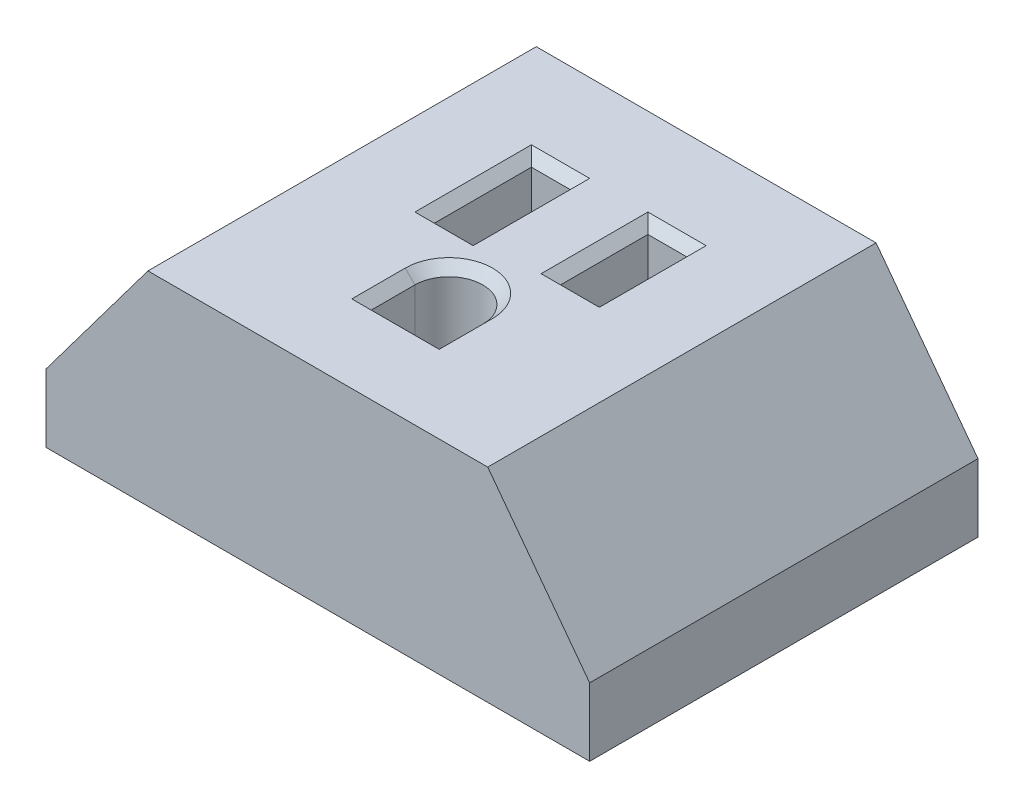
ISO-10303-21;
HEADER;
FILE_DESCRIPTION(('STEP AP214'),'2;1');
FILE_NAME('part.step','',(''),(''),'','','');
FILE_SCHEMA(('AUTOMOTIVE_DESIGN { 1 0 10303 214 1 1 1 1 }'));
ENDSEC;
DATA;
#1=APPLICATION_CONTEXT('core data for automotive mechanical design processes');
#2=APPLICATION_PROTOCOL_DEFINITION('international standard','automotive_design',2000,#1);
#3=PRODUCT_CONTEXT('',#1,'mechanical');
#4=PRODUCT('Part','Part','',(#3));
#5=PRODUCT_RELATED_PRODUCT_CATEGORY('part','',(#4));
#6=PRODUCT_DEFINITION_FORMATION('','',#4);
#7=PRODUCT_DEFINITION_CONTEXT('part definition',#1,'design');
#8=PRODUCT_DEFINITION('design','',#6,#7);
#9=PRODUCT_DEFINITION_SHAPE('','',#8);
#10=(LENGTH_UNIT() NAMED_UNIT(*) SI_UNIT(.MILLI.,.METRE.));
#11=(NAMED_UNIT(*) PLANE_ANGLE_UNIT() SI_UNIT($,.RADIAN.));
#12=(NAMED_UNIT(*) SI_UNIT($,.STERADIAN.) SOLID_ANGLE_UNIT());
#13=UNCERTAINTY_MEASURE_WITH_UNIT(LENGTH_MEASURE(1.E-05),#10,'distance_accuracy_value','');
#14=(GEOMETRIC_REPRESENTATION_CONTEXT(3) GLOBAL_UNCERTAINTY_ASSIGNED_CONTEXT((#13)) GLOBAL_UNIT_ASSIGNED_CONTEXT((#10,
#11,#12)) REPRESENTATION_CONTEXT('',''));
#15=CARTESIAN_POINT('',(0.,0.,0.));
#16=DIRECTION('',(0.,0.,1.));
#17=DIRECTION('',(1.,0.,0.));
#18=AXIS2_PLACEMENT_3D('',#15,#16,#17);
#19=CARTESIAN_POINT('',(-28.,0.,-40.));
#20=DIRECTION('',(-1.,0.,0.));
#21=DIRECTION('',(0.,0.,1.));
#22=AXIS2_PLACEMENT_3D('',#19,#20,#21);
#23=PLANE('',#22);
#24=DIRECTION('',(0.,-1.,0.));
#25=VECTOR('',#24,1.);
#26=CARTESIAN_POINT('',(-28.,0.,0.));
#27=LINE('',#26,#25);
#28=CARTESIAN_POINT('',(-28.,7.,0.));
#29=VERTEX_POINT('',#28);
#30=CARTESIAN_POINT('',(-28.,0.,0.));
#31=VERTEX_POINT('',#30);
#32=EDGE_CURVE('E270',#29,#31,#27,.T.);
#33=ORIENTED_EDGE('',*,*,#32,.F.);
#34=DIRECTION('',(0.,0.,1.));
#35=VECTOR('',#34,1.);
#36=CARTESIAN_POINT('',(-28.,7.,-40.));
#37=LINE('',#36,#35);
#38=CARTESIAN_POINT('',(-28.,7.,-40.));
#39=VERTEX_POINT('',#38);
#40=EDGE_CURVE('E307',#39,#29,#37,.T.);
#41=ORIENTED_EDGE('',*,*,#40,.F.);
#42=DIRECTION('',(0.,-1.,0.));
#43=VECTOR('',#42,1.);
#44=CARTESIAN_POINT('',(-28.,0.,-40.));
#45=LINE('',#44,#43);
#46=CARTESIAN_POINT('',(-28.,0.,-40.));
#47=VERTEX_POINT('',#46);
#48=EDGE_CURVE('E288',#39,#47,#45,.T.);
#49=ORIENTED_EDGE('',*,*,#48,.T.);
#50=DIRECTION('',(0.,0.,1.));
#51=VECTOR('',#50,1.);
#52=CARTESIAN_POINT('',(-28.,0.,-40.));
#53=LINE('',#52,#51);
#54=EDGE_CURVE('E306',#47,#31,#53,.T.);
#55=ORIENTED_EDGE('',*,*,#54,.T.);
#56=EDGE_LOOP('',(#33,#41,#49,#55));
#57=FACE_BOUND('',#56,.T.);
#58=ADVANCED_FACE('F28',(#57),#23,.T.);
#59=CARTESIAN_POINT('',(-28.,7.,-40.));
#60=DIRECTION('',(-0.8,0.6,0.));
#61=DIRECTION('',(-0.6,-0.8,0.));
#62=AXIS2_PLACEMENT_3D('',#59,#60,#61);
#63=PLANE('',#62);
#64=DIRECTION('',(-0.6,-0.8,0.));
#65=VECTOR('',#64,1.);
#66=CARTESIAN_POINT('',(-28.,7.,0.));
#67=LINE('',#66,#65);
#68=CARTESIAN_POINT('',(-17.5,21.,0.));
#69=VERTEX_POINT('',#68);
#70=EDGE_CURVE('E285',#69,#29,#67,.T.);
#71=ORIENTED_EDGE('',*,*,#70,.F.);
#72=DIRECTION('',(0.,0.,1.));
#73=VECTOR('',#72,1.);
#74=CARTESIAN_POINT('',(-17.5,21.,-40.));
#75=LINE('',#74,#73);
#76=CARTESIAN_POINT('',(-17.5,21.,-40.));
#77=VERTEX_POINT('',#76);
#78=EDGE_CURVE('E310',#77,#69,#75,.T.);
#79=ORIENTED_EDGE('',*,*,#78,.F.);
#80=DIRECTION('',(-0.6,-0.8,0.));
#81=VECTOR('',#80,1.);
#82=CARTESIAN_POINT('',(-28.,7.,-40.));
#83=LINE('',#82,#81);
#84=EDGE_CURVE('E303',#77,#39,#83,.T.);
#85=ORIENTED_EDGE('',*,*,#84,.T.);
#86=ORIENTED_EDGE('',*,*,#40,.T.);
#87=EDGE_LOOP('',(#71,#79,#85,#86));
#88=FACE_BOUND('',#87,.T.);
#89=ADVANCED_FACE('F447',(#88),#63,.T.);
#90=CARTESIAN_POINT('',(-17.5,21.,-40.));
#91=DIRECTION('',(0.,1.,0.));
#92=DIRECTION('',(0.,0.,1.));
#93=AXIS2_PLACEMENT_3D('',#90,#91,#92);
#94=PLANE('',#93);
#95=DIRECTION('',(0.,0.,-1.));
#96=VECTOR('',#95,1.);
#97=CARTESIAN_POINT('',(-4.5,21.,-13.5));
#98=LINE('',#97,#96);
#99=CARTESIAN_POINT('',(-4.5,21.,-7.99999999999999));
#100=VERTEX_POINT('',#99);
#101=CARTESIAN_POINT('',(-4.5,21.,-13.5));
#102=VERTEX_POINT('',#101);
#103=EDGE_CURVE('E342',#100,#102,#98,.T.);
#104=ORIENTED_EDGE('',*,*,#103,.T.);
#105=CARTESIAN_POINT('',(0.,21.,-13.5));
#106=DIRECTION('',(0.,1.,0.));
#107=DIRECTION('',(0.,0.,1.));
#108=AXIS2_PLACEMENT_3D('',#105,#106,#107);
#109=CIRCLE('',#108,4.5);
#110=CARTESIAN_POINT('',(4.50000000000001,21.,-13.5));
#111=VERTEX_POINT('',#110);
#112=EDGE_CURVE('E344',#102,#111,#109,.F.);
#113=ORIENTED_EDGE('',*,*,#112,.T.);
#114=DIRECTION('',(0.,0.,1.));
#115=VECTOR('',#114,1.);
#116=CARTESIAN_POINT('',(4.5,21.,-9.));
#117=LINE('',#116,#115);
#118=CARTESIAN_POINT('',(4.5,21.,-7.99999999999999));
#119=VERTEX_POINT('',#118);
#120=EDGE_CURVE('E338',#111,#119,#117,.T.);
#121=ORIENTED_EDGE('',*,*,#120,.T.);
#122=DIRECTION('',(-1.,0.,0.));
#123=VECTOR('',#122,1.);
#124=CARTESIAN_POINT('',(-3.5,21.,-7.99999999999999));
#125=LINE('',#124,#123);
#126=EDGE_CURVE('E340',#119,#100,#125,.T.);
#127=ORIENTED_EDGE('',*,*,#126,.T.);
#128=EDGE_LOOP('',(#104,#113,#121,#127));
#129=FACE_BOUND('',#128,.T.);
#130=DIRECTION('',(0.,0.,1.));
#131=VECTOR('',#130,1.);
#132=CARTESIAN_POINT('',(9.,21.,-21.));
#133=LINE('',#132,#131);
#134=CARTESIAN_POINT('',(9.,21.,-31.));
#135=VERTEX_POINT('',#134);
#136=CARTESIAN_POINT('',(9.,21.,-20.));
#137=VERTEX_POINT('',#136);
#138=EDGE_CURVE('E333',#135,#137,#133,.T.);
#139=ORIENTED_EDGE('',*,*,#138,.T.);
#140=DIRECTION('',(-1.,0.,0.));
#141=VECTOR('',#140,1.);
#142=CARTESIAN_POINT('',(4.,21.,-20.));
#143=LINE('',#142,#141);
#144=CARTESIAN_POINT('',(3.,21.,-20.));
#145=VERTEX_POINT('',#144);
#146=EDGE_CURVE('E335',#137,#145,#143,.T.);
#147=ORIENTED_EDGE('',*,*,#146,.T.);
#148=DIRECTION('',(0.,0.,-1.));
#149=VECTOR('',#148,1.);
#150=CARTESIAN_POINT('',(3.,21.,-30.));
#151=LINE('',#150,#149);
#152=CARTESIAN_POINT('',(3.,21.,-31.));
#153=VERTEX_POINT('',#152);
#154=EDGE_CURVE('E329',#145,#153,#151,.T.);
#155=ORIENTED_EDGE('',*,*,#154,.T.);
#156=DIRECTION('',(1.,0.,0.));
#157=VECTOR('',#156,1.);
#158=CARTESIAN_POINT('',(8.,21.,-31.));
#159=LINE('',#158,#157);
#160=EDGE_CURVE('E331',#153,#135,#159,.T.);
#161=ORIENTED_EDGE('',*,*,#160,.T.);
#162=EDGE_LOOP('',(#139,#147,#155,#161));
#163=FACE_BOUND('',#162,.T.);
#164=DIRECTION('',(0.,0.,1.));
#165=VECTOR('',#164,1.);
#166=CARTESIAN_POINT('',(-2.99999999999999,21.,-20.));
#167=LINE('',#166,#165);
#168=CARTESIAN_POINT('',(-2.99999999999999,21.,-31.));
#169=VERTEX_POINT('',#168);
#170=CARTESIAN_POINT('',(-2.99999999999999,21.,-19.));
#171=VERTEX_POINT('',#170);
#172=EDGE_CURVE('E324',#169,#171,#167,.T.);
#173=ORIENTED_EDGE('',*,*,#172,.T.);
#174=DIRECTION('',(-1.,0.,0.));
#175=VECTOR('',#174,1.);
#176=CARTESIAN_POINT('',(-8.,21.,-19.));
#177=LINE('',#176,#175);
#178=CARTESIAN_POINT('',(-9.,21.,-19.));
#179=VERTEX_POINT('',#178);
#180=EDGE_CURVE('E326',#171,#179,#177,.T.);
#181=ORIENTED_EDGE('',*,*,#180,.T.);
#182=DIRECTION('',(0.,0.,-1.));
#183=VECTOR('',#182,1.);
#184=CARTESIAN_POINT('',(-9.,21.,-30.));
#185=LINE('',#184,#183);
#186=CARTESIAN_POINT('',(-9.,21.,-31.));
#187=VERTEX_POINT('',#186);
#188=EDGE_CURVE('E320',#179,#187,#185,.T.);
#189=ORIENTED_EDGE('',*,*,#188,.T.);
#190=DIRECTION('',(1.,0.,0.));
#191=VECTOR('',#190,1.);
#192=CARTESIAN_POINT('',(-4.,21.,-31.));
#193=LINE('',#192,#191);
#194=EDGE_CURVE('E322',#187,#169,#193,.T.);
#195=ORIENTED_EDGE('',*,*,#194,.T.);
#196=EDGE_LOOP('',(#173,#181,#189,#195));
#197=FACE_BOUND('',#196,.T.);
#198=DIRECTION('',(-1.,0.,0.));
#199=VECTOR('',#198,1.);
#200=CARTESIAN_POINT('',(-17.5,21.,0.));
#201=LINE('',#200,#199);
#202=CARTESIAN_POINT('',(17.5,21.,0.));
#203=VERTEX_POINT('',#202);
#204=EDGE_CURVE('E282',#203,#69,#201,.T.);
#205=ORIENTED_EDGE('',*,*,#204,.F.);
#206=DIRECTION('',(0.,0.,1.));
#207=VECTOR('',#206,1.);
#208=CARTESIAN_POINT('',(17.5,21.,-40.));
#209=LINE('',#208,#207);
#210=CARTESIAN_POINT('',(17.5,21.,-40.));
#211=VERTEX_POINT('',#210);
#212=EDGE_CURVE('E312',#211,#203,#209,.T.);
#213=ORIENTED_EDGE('',*,*,#212,.F.);
#214=DIRECTION('',(-1.,0.,0.));
#215=VECTOR('',#214,1.);
#216=CARTESIAN_POINT('',(-17.5,21.,-40.));
#217=LINE('',#216,#215);
#218=EDGE_CURVE('E300',#211,#77,#217,.T.);
#219=ORIENTED_EDGE('',*,*,#218,.T.);
#220=ORIENTED_EDGE('',*,*,#78,.T.);
#221=EDGE_LOOP('',(#205,#213,#219,#220));
#222=FACE_BOUND('',#221,.T.);
#223=ADVANCED_FACE('F430',(#129,#163,#197,#222),#94,.T.);
#224=CARTESIAN_POINT('',(28.,7.,-40.));
#225=DIRECTION('',(0.8,0.6,0.));
#226=DIRECTION('',(-0.6,0.8,0.));
#227=AXIS2_PLACEMENT_3D('',#224,#225,#226);
#228=PLANE('',#227);
#229=DIRECTION('',(-0.6,0.8,0.));
#230=VECTOR('',#229,1.);
#231=CARTESIAN_POINT('',(28.,7.,0.));
#232=LINE('',#231,#230);
#233=CARTESIAN_POINT('',(28.,7.,0.));
#234=VERTEX_POINT('',#233);
#235=EDGE_CURVE('E279',#234,#203,#232,.T.);
#236=ORIENTED_EDGE('',*,*,#235,.F.);
#237=DIRECTION('',(0.,0.,1.));
#238=VECTOR('',#237,1.);
#239=CARTESIAN_POINT('',(28.,7.,-40.));
#240=LINE('',#239,#238);
#241=CARTESIAN_POINT('',(28.,7.,-40.));
#242=VERTEX_POINT('',#241);
#243=EDGE_CURVE('E314',#242,#234,#240,.T.);
#244=ORIENTED_EDGE('',*,*,#243,.F.);
#245=DIRECTION('',(-0.6,0.8,0.));
#246=VECTOR('',#245,1.);
#247=CARTESIAN_POINT('',(28.,7.,-40.));
#248=LINE('',#247,#246);
#249=EDGE_CURVE('E297',#242,#211,#248,.T.);
#250=ORIENTED_EDGE('',*,*,#249,.T.);
#251=ORIENTED_EDGE('',*,*,#212,.T.);
#252=EDGE_LOOP('',(#236,#244,#250,#251));
#253=FACE_BOUND('',#252,.T.);
#254=ADVANCED_FACE('F473',(#253),#228,.T.);
#255=CARTESIAN_POINT('',(28.,0.,-40.));
#256=DIRECTION('',(1.,0.,0.));
#257=DIRECTION('',(0.,0.,-1.));
#258=AXIS2_PLACEMENT_3D('',#255,#256,#257);
#259=PLANE('',#258);
#260=DIRECTION('',(0.,1.,0.));
#261=VECTOR('',#260,1.);
#262=CARTESIAN_POINT('',(28.,0.,0.));
#263=LINE('',#262,#261);
#264=CARTESIAN_POINT('',(28.,0.,0.));
#265=VERTEX_POINT('',#264);
#266=EDGE_CURVE('E276',#265,#234,#263,.T.);
#267=ORIENTED_EDGE('',*,*,#266,.F.);
#268=DIRECTION('',(0.,0.,1.));
#269=VECTOR('',#268,1.);
#270=CARTESIAN_POINT('',(28.,0.,-40.));
#271=LINE('',#270,#269);
#272=CARTESIAN_POINT('',(28.,0.,-40.));
#273=VERTEX_POINT('',#272);
#274=EDGE_CURVE('E316',#273,#265,#271,.T.);
#275=ORIENTED_EDGE('',*,*,#274,.F.);
#276=DIRECTION('',(0.,1.,0.));
#277=VECTOR('',#276,1.);
#278=CARTESIAN_POINT('',(28.,0.,-40.));
#279=LINE('',#278,#277);
#280=EDGE_CURVE('E294',#273,#242,#279,.T.);
#281=ORIENTED_EDGE('',*,*,#280,.T.);
#282=ORIENTED_EDGE('',*,*,#243,.T.);
#283=EDGE_LOOP('',(#267,#275,#281,#282));
#284=FACE_BOUND('',#283,.T.);
#285=ADVANCED_FACE('F471',(#284),#259,.T.);
#286=CARTESIAN_POINT('',(-28.,0.,-40.));
#287=DIRECTION('',(0.,-1.,0.));
#288=DIRECTION('',(0.,0.,-1.));
#289=AXIS2_PLACEMENT_3D('',#286,#287,#288);
#290=PLANE('',#289);
#291=DIRECTION('',(0.,0.,-1.));
#292=VECTOR('',#291,1.);
#293=CARTESIAN_POINT('',(3.5,0.,-9.));
#294=LINE('',#293,#292);
#295=CARTESIAN_POINT('',(3.5,0.,-9.));
#296=VERTEX_POINT('',#295);
#297=CARTESIAN_POINT('',(3.5,0.,-13.5));
#298=VERTEX_POINT('',#297);
#299=EDGE_CURVE('E207',#296,#298,#294,.T.);
#300=ORIENTED_EDGE('',*,*,#299,.T.);
#301=CARTESIAN_POINT('',(0.,0.,-13.5));
#302=DIRECTION('',(0.,-1.,0.));
#303=DIRECTION('',(0.,0.,-1.));
#304=AXIS2_PLACEMENT_3D('',#301,#302,#303);
#305=CIRCLE('',#304,3.5);
#306=CARTESIAN_POINT('',(-3.5,0.,-13.5));
#307=VERTEX_POINT('',#306);
#308=EDGE_CURVE('E189',#298,#307,#305,.F.);
#309=ORIENTED_EDGE('',*,*,#308,.T.);
#310=DIRECTION('',(0.,0.,1.));
#311=VECTOR('',#310,1.);
#312=CARTESIAN_POINT('',(-3.5,0.,-9.));
#313=LINE('',#312,#311);
#314=CARTESIAN_POINT('',(-3.5,0.,-9.));
#315=VERTEX_POINT('',#314);
#316=EDGE_CURVE('E217',#307,#315,#313,.T.);
#317=ORIENTED_EDGE('',*,*,#316,.T.);
#318=DIRECTION('',(1.,0.,0.));
#319=VECTOR('',#318,1.);
#320=CARTESIAN_POINT('',(-3.5,0.,-9.));
#321=LINE('',#320,#319);
#322=EDGE_CURVE('E215',#315,#296,#321,.T.);
#323=ORIENTED_EDGE('',*,*,#322,.T.);
#324=EDGE_LOOP('',(#300,#309,#317,#323));
#325=FACE_BOUND('',#324,.T.);
#326=DIRECTION('',(0.,0.,1.));
#327=VECTOR('',#326,1.);
#328=CARTESIAN_POINT('',(4.,0.,-30.));
#329=LINE('',#328,#327);
#330=CARTESIAN_POINT('',(4.,0.,-30.));
#331=VERTEX_POINT('',#330);
#332=CARTESIAN_POINT('',(4.,0.,-21.));
#333=VERTEX_POINT('',#332);
#334=EDGE_CURVE('E231',#331,#333,#329,.T.);
#335=ORIENTED_EDGE('',*,*,#334,.T.);
#336=DIRECTION('',(1.,0.,0.));
#337=VECTOR('',#336,1.);
#338=CARTESIAN_POINT('',(4.,0.,-21.));
#339=LINE('',#338,#337);
#340=CARTESIAN_POINT('',(8.,0.,-21.));
#341=VERTEX_POINT('',#340);
#342=EDGE_CURVE('E238',#333,#341,#339,.T.);
#343=ORIENTED_EDGE('',*,*,#342,.T.);
#344=DIRECTION('',(0.,0.,-1.));
#345=VECTOR('',#344,1.);
#346=CARTESIAN_POINT('',(8.,0.,-30.));
#347=LINE('',#346,#345);
#348=CARTESIAN_POINT('',(8.,0.,-30.));
#349=VERTEX_POINT('',#348);
#350=EDGE_CURVE('E201',#341,#349,#347,.T.);
#351=ORIENTED_EDGE('',*,*,#350,.T.);
#352=DIRECTION('',(-1.,0.,0.));
#353=VECTOR('',#352,1.);
#354=CARTESIAN_POINT('',(4.,0.,-30.));
#355=LINE('',#354,#353);
#356=EDGE_CURVE('E228',#349,#331,#355,.T.);
#357=ORIENTED_EDGE('',*,*,#356,.T.);
#358=EDGE_LOOP('',(#335,#343,#351,#357));
#359=FACE_BOUND('',#358,.T.);
#360=DIRECTION('',(0.,0.,1.));
#361=VECTOR('',#360,1.);
#362=CARTESIAN_POINT('',(-8.,0.,-30.));
#363=LINE('',#362,#361);
#364=CARTESIAN_POINT('',(-8.,0.,-30.));
#365=VERTEX_POINT('',#364);
#366=CARTESIAN_POINT('',(-7.99999999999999,0.,-20.));
#367=VERTEX_POINT('',#366);
#368=EDGE_CURVE('E255',#365,#367,#363,.T.);
#369=ORIENTED_EDGE('',*,*,#368,.T.);
#370=DIRECTION('',(1.,0.,0.));
#371=VECTOR('',#370,1.);
#372=CARTESIAN_POINT('',(-7.99999999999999,0.,-20.));
#373=LINE('',#372,#371);
#374=CARTESIAN_POINT('',(-4.,0.,-20.));
#375=VERTEX_POINT('',#374);
#376=EDGE_CURVE('E261',#367,#375,#373,.T.);
#377=ORIENTED_EDGE('',*,*,#376,.T.);
#378=DIRECTION('',(0.,0.,-1.));
#379=VECTOR('',#378,1.);
#380=CARTESIAN_POINT('',(-4.,0.,-30.));
#381=LINE('',#380,#379);
#382=CARTESIAN_POINT('',(-4.,0.,-30.));
#383=VERTEX_POINT('',#382);
#384=EDGE_CURVE('E249',#375,#383,#381,.T.);
#385=ORIENTED_EDGE('',*,*,#384,.T.);
#386=DIRECTION('',(-1.,0.,0.));
#387=VECTOR('',#386,1.);
#388=CARTESIAN_POINT('',(-8.,0.,-30.));
#389=LINE('',#388,#387);
#390=EDGE_CURVE('E252',#383,#365,#389,.T.);
#391=ORIENTED_EDGE('',*,*,#390,.T.);
#392=EDGE_LOOP('',(#369,#377,#385,#391));
#393=FACE_BOUND('',#392,.T.);
#394=DIRECTION('',(1.,0.,0.));
#395=VECTOR('',#394,1.);
#396=CARTESIAN_POINT('',(-28.,0.,0.));
#397=LINE('',#396,#395);
#398=EDGE_CURVE('E273',#31,#265,#397,.T.);
#399=ORIENTED_EDGE('',*,*,#398,.F.);
#400=ORIENTED_EDGE('',*,*,#54,.F.);
#401=DIRECTION('',(1.,0.,0.));
#402=VECTOR('',#401,1.);
#403=CARTESIAN_POINT('',(-28.,0.,-40.));
#404=LINE('',#403,#402);
#405=EDGE_CURVE('E291',#47,#273,#404,.T.);
#406=ORIENTED_EDGE('',*,*,#405,.T.);
#407=ORIENTED_EDGE('',*,*,#274,.T.);
#408=EDGE_LOOP('',(#399,#400,#406,#407));
#409=FACE_BOUND('',#408,.T.);
#410=ADVANCED_FACE('F213',(#325,#359,#393,#409),#290,.T.);
#411=CARTESIAN_POINT('',(-28.,21.,-40.));
#412=DIRECTION('',(0.,0.,-1.));
#413=DIRECTION('',(-1.,0.,0.));
#414=AXIS2_PLACEMENT_3D('',#411,#412,#413);
#415=PLANE('',#414);
#416=ORIENTED_EDGE('',*,*,#48,.F.);
#417=ORIENTED_EDGE('',*,*,#84,.F.);
#418=ORIENTED_EDGE('',*,*,#218,.F.);
#419=ORIENTED_EDGE('',*,*,#249,.F.);
#420=ORIENTED_EDGE('',*,*,#280,.F.);
#421=ORIENTED_EDGE('',*,*,#405,.F.);
#422=EDGE_LOOP('',(#416,#417,#418,#419,#420,#421));
#423=FACE_BOUND('',#422,.T.);
#424=ADVANCED_FACE('F464',(#423),#415,.T.);
#425=CARTESIAN_POINT('',(-28.,21.,0.));
#426=DIRECTION('',(0.,0.,-1.));
#427=DIRECTION('',(-1.,0.,0.));
#428=AXIS2_PLACEMENT_3D('',#425,#426,#427);
#429=PLANE('',#428);
#430=ORIENTED_EDGE('',*,*,#32,.T.);
#431=ORIENTED_EDGE('',*,*,#398,.T.);
#432=ORIENTED_EDGE('',*,*,#266,.T.);
#433=ORIENTED_EDGE('',*,*,#235,.T.);
#434=ORIENTED_EDGE('',*,*,#204,.T.);
#435=ORIENTED_EDGE('',*,*,#70,.T.);
#436=EDGE_LOOP('',(#430,#431,#432,#433,#434,#435));
#437=FACE_BOUND('',#436,.T.);
#438=ADVANCED_FACE('F459',(#437),#429,.F.);
#439=CARTESIAN_POINT('',(-8.,-0.001000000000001,-30.));
#440=DIRECTION('',(-1.,0.,0.));
#441=DIRECTION('',(0.,0.,1.));
#442=AXIS2_PLACEMENT_3D('',#439,#440,#441);
#443=PLANE('',#442);
#444=DIRECTION('',(0.,1.,0.));
#445=VECTOR('',#444,1.);
#446=CARTESIAN_POINT('',(-8.,-0.001000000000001,-30.));
#447=LINE('',#446,#445);
#448=CARTESIAN_POINT('',(-8.,20.,-30.));
#449=VERTEX_POINT('',#448);
#450=EDGE_CURVE('E259',#365,#449,#447,.T.);
#451=ORIENTED_EDGE('',*,*,#450,.T.);
#452=DIRECTION('',(0.,0.,1.));
#453=VECTOR('',#452,1.);
#454=CARTESIAN_POINT('',(-7.99999999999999,20.,-20.));
#455=LINE('',#454,#453);
#456=CARTESIAN_POINT('',(-7.99999999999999,20.,-20.));
#457=VERTEX_POINT('',#456);
#458=EDGE_CURVE('E11',#449,#457,#455,.T.);
#459=ORIENTED_EDGE('',*,*,#458,.T.);
#460=DIRECTION('',(0.,1.,0.));
#461=VECTOR('',#460,1.);
#462=CARTESIAN_POINT('',(-7.99999999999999,-0.001000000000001,-20.));
#463=LINE('',#462,#461);
#464=EDGE_CURVE('E258',#367,#457,#463,.T.);
#465=ORIENTED_EDGE('',*,*,#464,.F.);
#466=ORIENTED_EDGE('',*,*,#368,.F.);
#467=EDGE_LOOP('',(#451,#459,#465,#466));
#468=FACE_BOUND('',#467,.T.);
#469=ADVANCED_FACE('F375',(#468),#443,.F.);
#470=CARTESIAN_POINT('',(-8.,-0.001000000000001,-30.));
#471=DIRECTION('',(0.,0.,-1.));
#472=DIRECTION('',(-1.,0.,0.));
#473=AXIS2_PLACEMENT_3D('',#470,#471,#472);
#474=PLANE('',#473);
#475=DIRECTION('',(0.,1.,0.));
#476=VECTOR('',#475,1.);
#477=CARTESIAN_POINT('',(-4.,-0.001000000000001,-30.));
#478=LINE('',#477,#476);
#479=CARTESIAN_POINT('',(-4.,20.,-30.));
#480=VERTEX_POINT('',#479);
#481=EDGE_CURVE('E262',#383,#480,#478,.T.);
#482=ORIENTED_EDGE('',*,*,#481,.T.);
#483=DIRECTION('',(-1.,0.,0.));
#484=VECTOR('',#483,1.);
#485=CARTESIAN_POINT('',(-8.,20.,-30.));
#486=LINE('',#485,#484);
#487=EDGE_CURVE('E35',#480,#449,#486,.T.);
#488=ORIENTED_EDGE('',*,*,#487,.T.);
#489=ORIENTED_EDGE('',*,*,#450,.F.);
#490=ORIENTED_EDGE('',*,*,#390,.F.);
#491=EDGE_LOOP('',(#482,#488,#489,#490));
#492=FACE_BOUND('',#491,.T.);
#493=ADVANCED_FACE('F495',(#492),#474,.F.);
#494=CARTESIAN_POINT('',(-4.,-0.001000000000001,-30.));
#495=DIRECTION('',(1.,0.,0.));
#496=DIRECTION('',(0.,0.,-1.));
#497=AXIS2_PLACEMENT_3D('',#494,#495,#496);
#498=PLANE('',#497);
#499=DIRECTION('',(0.,1.,0.));
#500=VECTOR('',#499,1.);
#501=CARTESIAN_POINT('',(-4.,-0.001000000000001,-20.));
#502=LINE('',#501,#500);
#503=CARTESIAN_POINT('',(-4.,20.,-20.));
#504=VERTEX_POINT('',#503);
#505=EDGE_CURVE('E264',#375,#504,#502,.T.);
#506=ORIENTED_EDGE('',*,*,#505,.T.);
#507=DIRECTION('',(0.,0.,-1.));
#508=VECTOR('',#507,1.);
#509=CARTESIAN_POINT('',(-4.,20.,-30.));
#510=LINE('',#509,#508);
#511=EDGE_CURVE('E49',#504,#480,#510,.T.);
#512=ORIENTED_EDGE('',*,*,#511,.T.);
#513=ORIENTED_EDGE('',*,*,#481,.F.);
#514=ORIENTED_EDGE('',*,*,#384,.F.);
#515=EDGE_LOOP('',(#506,#512,#513,#514));
#516=FACE_BOUND('',#515,.T.);
#517=ADVANCED_FACE('F371',(#516),#498,.F.);
#518=CARTESIAN_POINT('',(-7.99999999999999,-0.001000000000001,-20.));
#519=DIRECTION('',(0.,0.,1.));
#520=DIRECTION('',(1.,0.,0.));
#521=AXIS2_PLACEMENT_3D('',#518,#519,#520);
#522=PLANE('',#521);
#523=ORIENTED_EDGE('',*,*,#464,.T.);
#524=DIRECTION('',(1.,0.,0.));
#525=VECTOR('',#524,1.);
#526=CARTESIAN_POINT('',(-4.,20.,-20.));
#527=LINE('',#526,#525);
#528=EDGE_CURVE('E361',#457,#504,#527,.T.);
#529=ORIENTED_EDGE('',*,*,#528,.T.);
#530=ORIENTED_EDGE('',*,*,#505,.F.);
#531=ORIENTED_EDGE('',*,*,#376,.F.);
#532=EDGE_LOOP('',(#523,#529,#530,#531));
#533=FACE_BOUND('',#532,.T.);
#534=ADVANCED_FACE('F366',(#533),#522,.F.);
#535=CARTESIAN_POINT('',(4.,-0.001000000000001,-30.));
#536=DIRECTION('',(-1.,0.,0.));
#537=DIRECTION('',(0.,0.,1.));
#538=AXIS2_PLACEMENT_3D('',#535,#536,#537);
#539=PLANE('',#538);
#540=DIRECTION('',(0.,1.,0.));
#541=VECTOR('',#540,1.);
#542=CARTESIAN_POINT('',(4.,-0.001000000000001,-30.));
#543=LINE('',#542,#541);
#544=CARTESIAN_POINT('',(4.,20.,-30.));
#545=VERTEX_POINT('',#544);
#546=EDGE_CURVE('E235',#331,#545,#543,.T.);
#547=ORIENTED_EDGE('',*,*,#546,.T.);
#548=DIRECTION('',(0.,0.,1.));
#549=VECTOR('',#548,1.);
#550=CARTESIAN_POINT('',(4.,20.,-21.));
#551=LINE('',#550,#549);
#552=CARTESIAN_POINT('',(4.,20.,-21.));
#553=VERTEX_POINT('',#552);
#554=EDGE_CURVE('E359',#545,#553,#551,.T.);
#555=ORIENTED_EDGE('',*,*,#554,.T.);
#556=DIRECTION('',(0.,1.,0.));
#557=VECTOR('',#556,1.);
#558=CARTESIAN_POINT('',(4.,-0.001000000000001,-21.));
#559=LINE('',#558,#557);
#560=EDGE_CURVE('E234',#333,#553,#559,.T.);
#561=ORIENTED_EDGE('',*,*,#560,.F.);
#562=ORIENTED_EDGE('',*,*,#334,.F.);
#563=EDGE_LOOP('',(#547,#555,#561,#562));
#564=FACE_BOUND('',#563,.T.);
#565=ADVANCED_FACE('F498',(#564),#539,.F.);
#566=CARTESIAN_POINT('',(4.,-0.001000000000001,-30.));
#567=DIRECTION('',(0.,0.,-1.));
#568=DIRECTION('',(-1.,0.,0.));
#569=AXIS2_PLACEMENT_3D('',#566,#567,#568);
#570=PLANE('',#569);
#571=DIRECTION('',(0.,1.,0.));
#572=VECTOR('',#571,1.);
#573=CARTESIAN_POINT('',(8.,-0.001000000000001,-30.));
#574=LINE('',#573,#572);
#575=CARTESIAN_POINT('',(8.,20.,-30.));
#576=VERTEX_POINT('',#575);
#577=EDGE_CURVE('E239',#349,#576,#574,.T.);
#578=ORIENTED_EDGE('',*,*,#577,.T.);
#579=DIRECTION('',(-1.,0.,0.));
#580=VECTOR('',#579,1.);
#581=CARTESIAN_POINT('',(4.,20.,-30.));
#582=LINE('',#581,#580);
#583=EDGE_CURVE('E357',#576,#545,#582,.T.);
#584=ORIENTED_EDGE('',*,*,#583,.T.);
#585=ORIENTED_EDGE('',*,*,#546,.F.);
#586=ORIENTED_EDGE('',*,*,#356,.F.);
#587=EDGE_LOOP('',(#578,#584,#585,#586));
#588=FACE_BOUND('',#587,.T.);
#589=ADVANCED_FACE('F505',(#588),#570,.F.);
#590=CARTESIAN_POINT('',(8.,-0.001000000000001,-30.));
#591=DIRECTION('',(1.,0.,0.));
#592=DIRECTION('',(0.,0.,-1.));
#593=AXIS2_PLACEMENT_3D('',#590,#591,#592);
#594=PLANE('',#593);
#595=DIRECTION('',(0.,1.,0.));
#596=VECTOR('',#595,1.);
#597=CARTESIAN_POINT('',(8.,-0.001000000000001,-21.));
#598=LINE('',#597,#596);
#599=CARTESIAN_POINT('',(8.,20.,-21.));
#600=VERTEX_POINT('',#599);
#601=EDGE_CURVE('E242',#341,#600,#598,.T.);
#602=ORIENTED_EDGE('',*,*,#601,.T.);
#603=DIRECTION('',(0.,0.,-1.));
#604=VECTOR('',#603,1.);
#605=CARTESIAN_POINT('',(8.,20.,-30.));
#606=LINE('',#605,#604);
#607=EDGE_CURVE('E355',#600,#576,#606,.T.);
#608=ORIENTED_EDGE('',*,*,#607,.T.);
#609=ORIENTED_EDGE('',*,*,#577,.F.);
#610=ORIENTED_EDGE('',*,*,#350,.F.);
#611=EDGE_LOOP('',(#602,#608,#609,#610));
#612=FACE_BOUND('',#611,.T.);
#613=ADVANCED_FACE('F510',(#612),#594,.F.);
#614=CARTESIAN_POINT('',(4.,-0.001000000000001,-21.));
#615=DIRECTION('',(0.,0.,1.));
#616=DIRECTION('',(1.,0.,0.));
#617=AXIS2_PLACEMENT_3D('',#614,#615,#616);
#618=PLANE('',#617);
#619=ORIENTED_EDGE('',*,*,#560,.T.);
#620=DIRECTION('',(1.,0.,0.));
#621=VECTOR('',#620,1.);
#622=CARTESIAN_POINT('',(8.,20.,-21.));
#623=LINE('',#622,#621);
#624=EDGE_CURVE('E352',#553,#600,#623,.T.);
#625=ORIENTED_EDGE('',*,*,#624,.T.);
#626=ORIENTED_EDGE('',*,*,#601,.F.);
#627=ORIENTED_EDGE('',*,*,#342,.F.);
#628=EDGE_LOOP('',(#619,#625,#626,#627));
#629=FACE_BOUND('',#628,.T.);
#630=ADVANCED_FACE('F507',(#629),#618,.F.);
#631=CARTESIAN_POINT('',(3.5,-0.001000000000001,-9.));
#632=DIRECTION('',(1.,0.,0.));
#633=DIRECTION('',(0.,0.,-1.));
#634=AXIS2_PLACEMENT_3D('',#631,#632,#633);
#635=PLANE('',#634);
#636=DIRECTION('',(0.,1.,0.));
#637=VECTOR('',#636,1.);
#638=CARTESIAN_POINT('',(3.5,-0.001000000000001,-9.));
#639=LINE('',#638,#637);
#640=CARTESIAN_POINT('',(3.5,20.,-9.));
#641=VERTEX_POINT('',#640);
#642=EDGE_CURVE('E202',#296,#641,#639,.T.);
#643=ORIENTED_EDGE('',*,*,#642,.T.);
#644=DIRECTION('',(0.,0.,-1.));
#645=VECTOR('',#644,1.);
#646=CARTESIAN_POINT('',(3.5,20.,-13.5));
#647=LINE('',#646,#645);
#648=CARTESIAN_POINT('',(3.5,20.,-13.5));
#649=VERTEX_POINT('',#648);
#650=EDGE_CURVE('E210',#641,#649,#647,.T.);
#651=ORIENTED_EDGE('',*,*,#650,.T.);
#652=DIRECTION('',(0.,1.,0.));
#653=VECTOR('',#652,1.);
#654=CARTESIAN_POINT('',(3.5,-0.001000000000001,-13.5));
#655=LINE('',#654,#653);
#656=EDGE_CURVE('E193',#298,#649,#655,.T.);
#657=ORIENTED_EDGE('',*,*,#656,.F.);
#658=ORIENTED_EDGE('',*,*,#299,.F.);
#659=EDGE_LOOP('',(#643,#651,#657,#658));
#660=FACE_BOUND('',#659,.T.);
#661=ADVANCED_FACE('F206',(#660),#635,.F.);
#662=CARTESIAN_POINT('',(-3.5,-0.001000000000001,-9.));
#663=DIRECTION('',(0.,0.,1.));
#664=DIRECTION('',(1.,0.,0.));
#665=AXIS2_PLACEMENT_3D('',#662,#663,#664);
#666=PLANE('',#665);
#667=DIRECTION('',(0.,1.,0.));
#668=VECTOR('',#667,1.);
#669=CARTESIAN_POINT('',(-3.5,-0.001000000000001,-9.));
#670=LINE('',#669,#668);
#671=CARTESIAN_POINT('',(-3.5,20.,-9.));
#672=VERTEX_POINT('',#671);
#673=EDGE_CURVE('E222',#315,#672,#670,.T.);
#674=ORIENTED_EDGE('',*,*,#673,.T.);
#675=DIRECTION('',(1.,0.,0.));
#676=VECTOR('',#675,1.);
#677=CARTESIAN_POINT('',(3.5,20.,-9.));
#678=LINE('',#677,#676);
#679=EDGE_CURVE('E349',#672,#641,#678,.T.);
#680=ORIENTED_EDGE('',*,*,#679,.T.);
#681=ORIENTED_EDGE('',*,*,#642,.F.);
#682=ORIENTED_EDGE('',*,*,#322,.F.);
#683=EDGE_LOOP('',(#674,#680,#681,#682));
#684=FACE_BOUND('',#683,.T.);
#685=ADVANCED_FACE('F418',(#684),#666,.F.);
#686=CARTESIAN_POINT('',(-3.5,-0.001000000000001,-9.));
#687=DIRECTION('',(-1.,0.,0.));
#688=DIRECTION('',(0.,0.,1.));
#689=AXIS2_PLACEMENT_3D('',#686,#687,#688);
#690=PLANE('',#689);
#691=DIRECTION('',(0.,1.,0.));
#692=VECTOR('',#691,1.);
#693=CARTESIAN_POINT('',(-3.5,-0.001000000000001,-13.5));
#694=LINE('',#693,#692);
#695=CARTESIAN_POINT('',(-3.5,20.,-13.5));
#696=VERTEX_POINT('',#695);
#697=EDGE_CURVE('E196',#307,#696,#694,.T.);
#698=ORIENTED_EDGE('',*,*,#697,.T.);
#699=DIRECTION('',(0.,0.,1.));
#700=VECTOR('',#699,1.);
#701=CARTESIAN_POINT('',(-3.5,20.,-9.));
#702=LINE('',#701,#700);
#703=EDGE_CURVE('E347',#696,#672,#702,.T.);
#704=ORIENTED_EDGE('',*,*,#703,.T.);
#705=ORIENTED_EDGE('',*,*,#673,.F.);
#706=ORIENTED_EDGE('',*,*,#316,.F.);
#707=EDGE_LOOP('',(#698,#704,#705,#706));
#708=FACE_BOUND('',#707,.T.);
#709=ADVANCED_FACE('F414',(#708),#690,.F.);
#710=CARTESIAN_POINT('',(0.,-0.001000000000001,-13.5));
#711=DIRECTION('',(0.,1.,0.));
#712=DIRECTION('',(0.,0.,1.));
#713=AXIS2_PLACEMENT_3D('',#710,#711,#712);
#714=CYLINDRICAL_SURFACE('',#713,3.5);
#715=ORIENTED_EDGE('',*,*,#656,.T.);
#716=CARTESIAN_POINT('',(0.,20.,-13.5));
#717=DIRECTION('',(0.,1.,0.));
#718=DIRECTION('',(0.,0.,1.));
#719=AXIS2_PLACEMENT_3D('',#716,#717,#718);
#720=CIRCLE('',#719,3.5);
#721=EDGE_CURVE('E309',#649,#696,#720,.T.);
#722=ORIENTED_EDGE('',*,*,#721,.T.);
#723=ORIENTED_EDGE('',*,*,#697,.F.);
#724=ORIENTED_EDGE('',*,*,#308,.F.);
#725=EDGE_LOOP('',(#715,#722,#723,#724));
#726=FACE_BOUND('',#725,.T.);
#727=ADVANCED_FACE('F191',(#726),#714,.F.);
#728=CARTESIAN_POINT('',(-3.5,20.,-9.));
#729=DIRECTION('',(0.,0.707106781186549,-0.707106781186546));
#730=DIRECTION('',(0.,0.707106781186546,0.707106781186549));
#731=AXIS2_PLACEMENT_3D('',#728,#729,#730);
#732=PLANE('',#731);
#733=DIRECTION('',(-0.577350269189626,0.577350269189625,0.577350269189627));
#734=VECTOR('',#733,1.);
#735=CARTESIAN_POINT('',(-3.5,20.,-9.));
#736=LINE('',#735,#734);
#737=EDGE_CURVE('E407',#100,#672,#736,.F.);
#738=ORIENTED_EDGE('',*,*,#737,.F.);
#739=ORIENTED_EDGE('',*,*,#126,.F.);
#740=DIRECTION('',(0.577350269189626,0.577350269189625,0.577350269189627));
#741=VECTOR('',#740,1.);
#742=CARTESIAN_POINT('',(1.16666666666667,17.6666666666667,-11.3333333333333));
#743=LINE('',#742,#741);
#744=EDGE_CURVE('E410',#641,#119,#743,.T.);
#745=ORIENTED_EDGE('',*,*,#744,.F.);
#746=ORIENTED_EDGE('',*,*,#679,.F.);
#747=EDGE_LOOP('',(#738,#739,#745,#746));
#748=FACE_BOUND('',#747,.T.);
#749=ADVANCED_FACE('F422',(#748),#732,.T.);
#750=CARTESIAN_POINT('',(3.5,20.,-9.));
#751=DIRECTION('',(-0.707106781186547,0.707106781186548,0.));
#752=DIRECTION('',(-0.707106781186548,-0.707106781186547,0.));
#753=AXIS2_PLACEMENT_3D('',#750,#751,#752);
#754=PLANE('',#753);
#755=ORIENTED_EDGE('',*,*,#744,.T.);
#756=ORIENTED_EDGE('',*,*,#120,.F.);
#757=DIRECTION('',(0.707106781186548,0.707106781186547,0.));
#758=VECTOR('',#757,1.);
#759=CARTESIAN_POINT('',(3.5,20.,-13.5));
#760=LINE('',#759,#758);
#761=EDGE_CURVE('E405',#649,#111,#760,.T.);
#762=ORIENTED_EDGE('',*,*,#761,.F.);
#763=ORIENTED_EDGE('',*,*,#650,.F.);
#764=EDGE_LOOP('',(#755,#756,#762,#763));
#765=FACE_BOUND('',#764,.T.);
#766=ADVANCED_FACE('F437',(#765),#754,.T.);
#767=CARTESIAN_POINT('',(-3.5,20.,-9.));
#768=DIRECTION('',(0.707106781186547,0.707106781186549,0.));
#769=DIRECTION('',(-0.707106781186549,0.707106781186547,0.));
#770=AXIS2_PLACEMENT_3D('',#767,#768,#769);
#771=PLANE('',#770);
#772=ORIENTED_EDGE('',*,*,#737,.T.);
#773=ORIENTED_EDGE('',*,*,#703,.F.);
#774=DIRECTION('',(0.707106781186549,-0.707106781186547,0.));
#775=VECTOR('',#774,1.);
#776=CARTESIAN_POINT('',(-4.5,21.,-13.5));
#777=LINE('',#776,#775);
#778=EDGE_CURVE('E403',#102,#696,#777,.T.);
#779=ORIENTED_EDGE('',*,*,#778,.F.);
#780=ORIENTED_EDGE('',*,*,#103,.F.);
#781=EDGE_LOOP('',(#772,#773,#779,#780));
#782=FACE_BOUND('',#781,.T.);
#783=ADVANCED_FACE('F426',(#782),#771,.T.);
#784=CARTESIAN_POINT('',(0.,20.,-13.5));
#785=DIRECTION('',(0.,1.,0.));
#786=DIRECTION('',(0.,0.,1.));
#787=AXIS2_PLACEMENT_3D('',#784,#785,#786);
#788=CONICAL_SURFACE('',#787,3.5,0.785398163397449);
#789=ORIENTED_EDGE('',*,*,#761,.T.);
#790=ORIENTED_EDGE('',*,*,#112,.F.);
#791=ORIENTED_EDGE('',*,*,#778,.T.);
#792=ORIENTED_EDGE('',*,*,#721,.F.);
#793=EDGE_LOOP('',(#789,#790,#791,#792));
#794=FACE_BOUND('',#793,.T.);
#795=ADVANCED_FACE('F433',(#794),#788,.F.);
#796=CARTESIAN_POINT('',(4.,20.,-30.));
#797=DIRECTION('',(0.,0.707106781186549,0.707106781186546));
#798=DIRECTION('',(0.,-0.707106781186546,0.707106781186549));
#799=AXIS2_PLACEMENT_3D('',#796,#797,#798);
#800=PLANE('',#799);
#801=DIRECTION('',(0.577350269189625,0.577350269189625,-0.577350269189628));
#802=VECTOR('',#801,1.);
#803=CARTESIAN_POINT('',(8.,20.,-30.));
#804=LINE('',#803,#802);
#805=EDGE_CURVE('E397',#135,#576,#804,.F.);
#806=ORIENTED_EDGE('',*,*,#805,.F.);
#807=ORIENTED_EDGE('',*,*,#160,.F.);
#808=DIRECTION('',(-0.577350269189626,0.577350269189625,-0.577350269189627));
#809=VECTOR('',#808,1.);
#810=CARTESIAN_POINT('',(4.,20.,-30.));
#811=LINE('',#810,#809);
#812=EDGE_CURVE('E400',#545,#153,#811,.T.);
#813=ORIENTED_EDGE('',*,*,#812,.F.);
#814=ORIENTED_EDGE('',*,*,#583,.F.);
#815=EDGE_LOOP('',(#806,#807,#813,#814));
#816=FACE_BOUND('',#815,.T.);
#817=ADVANCED_FACE('F554',(#816),#800,.T.);
#818=CARTESIAN_POINT('',(4.,20.,-30.));
#819=DIRECTION('',(0.707106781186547,0.707106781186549,0.));
#820=DIRECTION('',(-0.707106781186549,0.707106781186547,0.));
#821=AXIS2_PLACEMENT_3D('',#818,#819,#820);
#822=PLANE('',#821);
#823=ORIENTED_EDGE('',*,*,#812,.T.);
#824=ORIENTED_EDGE('',*,*,#154,.F.);
#825=DIRECTION('',(0.577350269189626,-0.577350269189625,-0.577350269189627));
#826=VECTOR('',#825,1.);
#827=CARTESIAN_POINT('',(4.,20.,-21.));
#828=LINE('',#827,#826);
#829=EDGE_CURVE('E395',#553,#145,#828,.F.);
#830=ORIENTED_EDGE('',*,*,#829,.F.);
#831=ORIENTED_EDGE('',*,*,#554,.F.);
#832=EDGE_LOOP('',(#823,#824,#830,#831));
#833=FACE_BOUND('',#832,.T.);
#834=ADVANCED_FACE('F561',(#833),#822,.T.);
#835=CARTESIAN_POINT('',(8.,20.,-30.));
#836=DIRECTION('',(-0.707106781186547,0.707106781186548,0.));
#837=DIRECTION('',(-0.707106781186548,-0.707106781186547,0.));
#838=AXIS2_PLACEMENT_3D('',#835,#836,#837);
#839=PLANE('',#838);
#840=ORIENTED_EDGE('',*,*,#805,.T.);
#841=ORIENTED_EDGE('',*,*,#607,.F.);
#842=DIRECTION('',(0.577350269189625,0.577350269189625,0.577350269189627));
#843=VECTOR('',#842,1.);
#844=CARTESIAN_POINT('',(6.66666666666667,18.6666666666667,-22.3333333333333));
#845=LINE('',#844,#843);
#846=EDGE_CURVE('E393',#137,#600,#845,.F.);
#847=ORIENTED_EDGE('',*,*,#846,.F.);
#848=ORIENTED_EDGE('',*,*,#138,.F.);
#849=EDGE_LOOP('',(#840,#841,#847,#848));
#850=FACE_BOUND('',#849,.T.);
#851=ADVANCED_FACE('F569',(#850),#839,.T.);
#852=CARTESIAN_POINT('',(4.,20.,-21.));
#853=DIRECTION('',(0.,0.707106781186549,-0.707106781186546));
#854=DIRECTION('',(0.,0.707106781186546,0.707106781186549));
#855=AXIS2_PLACEMENT_3D('',#852,#853,#854);
#856=PLANE('',#855);
#857=ORIENTED_EDGE('',*,*,#829,.T.);
#858=ORIENTED_EDGE('',*,*,#146,.F.);
#859=ORIENTED_EDGE('',*,*,#846,.T.);
#860=ORIENTED_EDGE('',*,*,#624,.F.);
#861=EDGE_LOOP('',(#857,#858,#859,#860));
#862=FACE_BOUND('',#861,.T.);
#863=ADVANCED_FACE('F577',(#862),#856,.T.);
#864=CARTESIAN_POINT('',(-8.,20.,-30.));
#865=DIRECTION('',(0.,0.707106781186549,0.707106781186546));
#866=DIRECTION('',(0.,-0.707106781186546,0.707106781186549));
#867=AXIS2_PLACEMENT_3D('',#864,#865,#866);
#868=PLANE('',#867);
#869=DIRECTION('',(0.577350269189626,0.577350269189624,-0.577350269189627));
#870=VECTOR('',#869,1.);
#871=CARTESIAN_POINT('',(-4.,20.,-30.));
#872=LINE('',#871,#870);
#873=EDGE_CURVE('E385',#169,#480,#872,.F.);
#874=ORIENTED_EDGE('',*,*,#873,.F.);
#875=ORIENTED_EDGE('',*,*,#194,.F.);
#876=DIRECTION('',(-0.577350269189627,0.577350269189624,-0.577350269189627));
#877=VECTOR('',#876,1.);
#878=CARTESIAN_POINT('',(-8.,20.,-30.));
#879=LINE('',#878,#877);
#880=EDGE_CURVE('E382',#449,#187,#879,.T.);
#881=ORIENTED_EDGE('',*,*,#880,.F.);
#882=ORIENTED_EDGE('',*,*,#487,.F.);
#883=EDGE_LOOP('',(#874,#875,#881,#882));
#884=FACE_BOUND('',#883,.T.);
#885=ADVANCED_FACE('F585',(#884),#868,.T.);
#886=CARTESIAN_POINT('',(-8.,20.,-30.));
#887=DIRECTION('',(0.707106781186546,0.707106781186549,0.));
#888=DIRECTION('',(-0.707106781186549,0.707106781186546,0.));
#889=AXIS2_PLACEMENT_3D('',#886,#887,#888);
#890=PLANE('',#889);
#891=ORIENTED_EDGE('',*,*,#880,.T.);
#892=ORIENTED_EDGE('',*,*,#188,.F.);
#893=DIRECTION('',(0.577350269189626,-0.577350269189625,-0.577350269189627));
#894=VECTOR('',#893,1.);
#895=CARTESIAN_POINT('',(-7.99999999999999,20.,-20.));
#896=LINE('',#895,#894);
#897=EDGE_CURVE('E383',#457,#179,#896,.F.);
#898=ORIENTED_EDGE('',*,*,#897,.F.);
#899=ORIENTED_EDGE('',*,*,#458,.F.);
#900=EDGE_LOOP('',(#891,#892,#898,#899));
#901=FACE_BOUND('',#900,.T.);
#902=ADVANCED_FACE('F380',(#901),#890,.T.);
#903=CARTESIAN_POINT('',(-4.,20.,-30.));
#904=DIRECTION('',(-0.707106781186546,0.707106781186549,0.));
#905=DIRECTION('',(-0.707106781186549,-0.707106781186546,0.));
#906=AXIS2_PLACEMENT_3D('',#903,#904,#905);
#907=PLANE('',#906);
#908=ORIENTED_EDGE('',*,*,#873,.T.);
#909=ORIENTED_EDGE('',*,*,#511,.F.);
#910=DIRECTION('',(0.577350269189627,0.577350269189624,0.577350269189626));
#911=VECTOR('',#910,1.);
#912=CARTESIAN_POINT('',(-5.33333333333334,18.6666666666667,-21.3333333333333));
#913=LINE('',#912,#911);
#914=EDGE_CURVE('E386',#171,#504,#913,.F.);
#915=ORIENTED_EDGE('',*,*,#914,.F.);
#916=ORIENTED_EDGE('',*,*,#172,.F.);
#917=EDGE_LOOP('',(#908,#909,#915,#916));
#918=FACE_BOUND('',#917,.T.);
#919=ADVANCED_FACE('F600',(#918),#907,.T.);
#920=CARTESIAN_POINT('',(-7.99999999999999,20.,-20.));
#921=DIRECTION('',(0.,0.707106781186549,-0.707106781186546));
#922=DIRECTION('',(0.,0.707106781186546,0.707106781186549));
#923=AXIS2_PLACEMENT_3D('',#920,#921,#922);
#924=PLANE('',#923);
#925=ORIENTED_EDGE('',*,*,#897,.T.);
#926=ORIENTED_EDGE('',*,*,#180,.F.);
#927=ORIENTED_EDGE('',*,*,#914,.T.);
#928=ORIENTED_EDGE('',*,*,#528,.F.);
#929=EDGE_LOOP('',(#925,#926,#927,#928));
#930=FACE_BOUND('',#929,.T.);
#931=ADVANCED_FACE('F607',(#930),#924,.T.);
#932=CLOSED_SHELL('',(#58,#89,#223,#254,#285,#410,#424,#438,#469,#493,#517,#534,#565,#589,#613,
#630,#661,#685,#709,#727,#749,#766,#783,#795,#817,#834,#851,#863,#885,#902,#919,#931));
#933=MANIFOLD_SOLID_BREP('B2',#932);
#934=ADVANCED_BREP_SHAPE_REPRESENTATION('',(#18,#933),#14);
#935=SHAPE_DEFINITION_REPRESENTATION(#9,#934);
ENDSEC;
END-ISO-10303-21;
